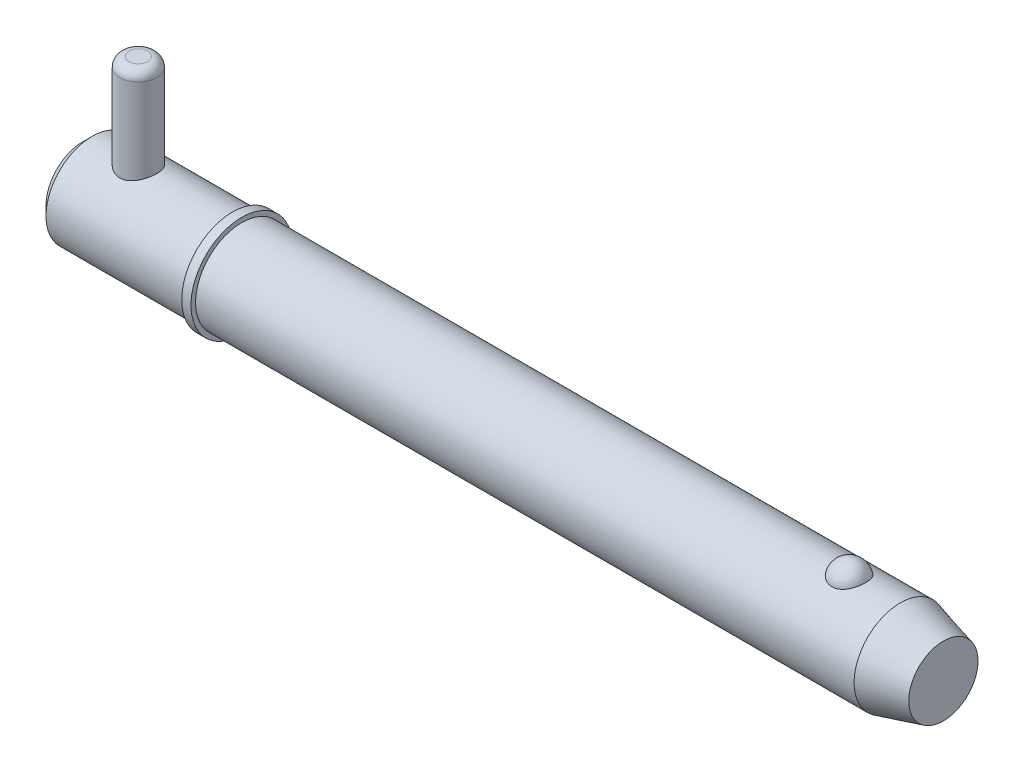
ISO-10303-21;
HEADER;
FILE_DESCRIPTION(('STEP AP214'),'2;1');
FILE_NAME('part.step','',(''),(''),'','','');
FILE_SCHEMA(('AUTOMOTIVE_DESIGN { 1 0 10303 214 1 1 1 1 }'));
ENDSEC;
DATA;
#1=APPLICATION_CONTEXT('core data for automotive mechanical design processes');
#2=APPLICATION_PROTOCOL_DEFINITION('international standard','automotive_design',2000,#1);
#3=PRODUCT_CONTEXT('',#1,'mechanical');
#4=PRODUCT('Part','Part','',(#3));
#5=PRODUCT_RELATED_PRODUCT_CATEGORY('part','',(#4));
#6=PRODUCT_DEFINITION_FORMATION('','',#4);
#7=PRODUCT_DEFINITION_CONTEXT('part definition',#1,'design');
#8=PRODUCT_DEFINITION('design','',#6,#7);
#9=PRODUCT_DEFINITION_SHAPE('','',#8);
#10=(LENGTH_UNIT() NAMED_UNIT(*) SI_UNIT(.MILLI.,.METRE.));
#11=(NAMED_UNIT(*) PLANE_ANGLE_UNIT() SI_UNIT($,.RADIAN.));
#12=(NAMED_UNIT(*) SI_UNIT($,.STERADIAN.) SOLID_ANGLE_UNIT());
#13=UNCERTAINTY_MEASURE_WITH_UNIT(LENGTH_MEASURE(1.E-05),#10,'distance_accuracy_value','');
#14=(GEOMETRIC_REPRESENTATION_CONTEXT(3) GLOBAL_UNCERTAINTY_ASSIGNED_CONTEXT((#13)) GLOBAL_UNIT_ASSIGNED_CONTEXT((#10,
#11,#12)) REPRESENTATION_CONTEXT('',''));
#15=CARTESIAN_POINT('',(0.,0.,0.));
#16=DIRECTION('',(0.,0.,1.));
#17=DIRECTION('',(1.,0.,0.));
#18=AXIS2_PLACEMENT_3D('',#15,#16,#17);
#19=CARTESIAN_POINT('',(9.525,23.81,0.));
#20=DIRECTION('',(0.,-1.,0.));
#21=DIRECTION('',(0.,0.,-1.));
#22=AXIS2_PLACEMENT_3D('',#19,#20,#21);
#23=CYLINDRICAL_SURFACE('',#22,3.175);
#24=CARTESIAN_POINT('',(9.525,-6.3525,0.));
#25=DIRECTION('',(0.,1.,0.));
#26=DIRECTION('',(0.,0.,1.));
#27=AXIS2_PLACEMENT_3D('',#24,#25,#26);
#28=CIRCLE('',#27,3.175);
#29=CARTESIAN_POINT('',(9.525,-6.3525,3.175));
#30=VERTEX_POINT('',#29);
#31=EDGE_CURVE('P0_E25',#30,#30,#28,.T.);
#32=ORIENTED_EDGE('',*,*,#31,.T.);
#33=EDGE_LOOP('',(#32));
#34=FACE_BOUND('',#33,.T.);
#35=CARTESIAN_POINT('',(9.525,22.2225,0.));
#36=DIRECTION('',(0.,1.,0.));
#37=DIRECTION('',(0.,0.,1.));
#38=AXIS2_PLACEMENT_3D('',#35,#36,#37);
#39=CIRCLE('',#38,3.175);
#40=CARTESIAN_POINT('',(9.525,22.2225,3.175));
#41=VERTEX_POINT('',#40);
#42=EDGE_CURVE('P0_E29',#41,#41,#39,.F.);
#43=ORIENTED_EDGE('',*,*,#42,.T.);
#44=EDGE_LOOP('',(#43));
#45=FACE_BOUND('',#44,.T.);
#46=ADVANCED_FACE('P0_F14',(#34,#45),#23,.T.);
#47=CARTESIAN_POINT('',(9.525,23.81,0.));
#48=DIRECTION('',(0.,1.,0.));
#49=DIRECTION('',(0.,0.,1.));
#50=AXIS2_PLACEMENT_3D('',#47,#48,#49);
#51=PLANE('',#50);
#52=CARTESIAN_POINT('',(9.525,23.81,0.));
#53=DIRECTION('',(0.,1.,0.));
#54=DIRECTION('',(0.,0.,1.));
#55=AXIS2_PLACEMENT_3D('',#52,#53,#54);
#56=CIRCLE('',#55,1.5875);
#57=CARTESIAN_POINT('',(9.525,23.81,1.5875));
#58=VERTEX_POINT('',#57);
#59=EDGE_CURVE('P0_E10',#58,#58,#56,.T.);
#60=ORIENTED_EDGE('',*,*,#59,.T.);
#61=EDGE_LOOP('',(#60));
#62=FACE_BOUND('',#61,.T.);
#63=ADVANCED_FACE('P0_F46',(#62),#51,.T.);
#64=CARTESIAN_POINT('',(9.525,-7.94,0.));
#65=DIRECTION('',(0.,1.,0.));
#66=DIRECTION('',(0.,0.,1.));
#67=AXIS2_PLACEMENT_3D('',#64,#65,#66);
#68=PLANE('',#67);
#69=CARTESIAN_POINT('',(9.525,-7.94,0.));
#70=DIRECTION('',(0.,1.,0.));
#71=DIRECTION('',(0.,0.,1.));
#72=AXIS2_PLACEMENT_3D('',#69,#70,#71);
#73=CIRCLE('',#72,1.5875);
#74=CARTESIAN_POINT('',(9.525,-7.94,1.5875));
#75=VERTEX_POINT('',#74);
#76=EDGE_CURVE('P0_E21',#75,#75,#73,.F.);
#77=ORIENTED_EDGE('',*,*,#76,.T.);
#78=EDGE_LOOP('',(#77));
#79=FACE_BOUND('',#78,.T.);
#80=ADVANCED_FACE('P0_F43',(#79),#68,.F.);
#81=CARTESIAN_POINT('',(9.525,-6.3525,0.));
#82=DIRECTION('',(0.,1.,0.));
#83=DIRECTION('',(0.,0.,1.));
#84=AXIS2_PLACEMENT_3D('',#81,#82,#83);
#85=DEGENERATE_TOROIDAL_SURFACE('',#84,1.5875,1.5875,.T.);
#86=ORIENTED_EDGE('',*,*,#76,.F.);
#87=EDGE_LOOP('',(#86));
#88=FACE_BOUND('',#87,.T.);
#89=ORIENTED_EDGE('',*,*,#31,.F.);
#90=EDGE_LOOP('',(#89));
#91=FACE_BOUND('',#90,.T.);
#92=ADVANCED_FACE('P0_F38',(#88,#91),#85,.T.);
#93=CARTESIAN_POINT('',(9.525,22.2225,0.));
#94=DIRECTION('',(0.,1.,0.));
#95=DIRECTION('',(0.,0.,1.));
#96=AXIS2_PLACEMENT_3D('',#93,#94,#95);
#97=DEGENERATE_TOROIDAL_SURFACE('',#96,1.5875,1.5875,.T.);
#98=ORIENTED_EDGE('',*,*,#42,.F.);
#99=EDGE_LOOP('',(#98));
#100=FACE_BOUND('',#99,.T.);
#101=ORIENTED_EDGE('',*,*,#59,.F.);
#102=EDGE_LOOP('',(#101));
#103=FACE_BOUND('',#102,.T.);
#104=ADVANCED_FACE('P0_F16',(#100,#103),#97,.T.);
#105=CLOSED_SHELL('',(#46,#63,#80,#92,#104));
#106=MANIFOLD_SOLID_BREP('P0_B1',#105);
#107=CARTESIAN_POINT('',(0.,0.,0.));
#108=DIRECTION('',(1.,0.,0.));
#109=DIRECTION('',(0.,0.,-1.));
#110=AXIS2_PLACEMENT_3D('',#107,#108,#109);
#111=CYLINDRICAL_SURFACE('',#110,7.94);
#112=CARTESIAN_POINT('',(140.551879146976,0.,0.));
#113=DIRECTION('',(1.,0.,0.));
#114=DIRECTION('',(0.,0.,-1.));
#115=AXIS2_PLACEMENT_3D('',#112,#113,#114);
#116=CIRCLE('',#115,7.94);
#117=CARTESIAN_POINT('',(140.551879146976,0.,-7.94));
#118=VERTEX_POINT('',#117);
#119=EDGE_CURVE('P1_E81',#118,#118,#116,.T.);
#120=ORIENTED_EDGE('',*,*,#119,.F.);
#121=EDGE_LOOP('',(#120));
#122=FACE_BOUND('',#121,.T.);
#123=CARTESIAN_POINT('',(27.31,0.,0.));
#124=DIRECTION('',(1.,0.,0.));
#125=DIRECTION('',(0.,0.,-1.));
#126=AXIS2_PLACEMENT_3D('',#123,#124,#125);
#127=CIRCLE('',#126,7.94);
#128=CARTESIAN_POINT('',(27.31,0.,-7.94));
#129=VERTEX_POINT('',#128);
#130=EDGE_CURVE('P1_E85',#129,#129,#127,.T.);
#131=ORIENTED_EDGE('',*,*,#130,.T.);
#132=EDGE_LOOP('',(#131));
#133=FACE_BOUND('',#132,.T.);
#134=CARTESIAN_POINT('',(131.744907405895,7.37767842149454,2.93486986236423));
#135=CARTESIAN_POINT('',(131.592749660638,7.3776732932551,2.93487505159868));
#136=CARTESIAN_POINT('',(131.440632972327,7.38258419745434,2.92262454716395));
#137=CARTESIAN_POINT('',(131.140928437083,7.40163229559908,2.87404196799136));
#138=CARTESIAN_POINT('',(130.993339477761,7.41576720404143,2.83771585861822));
#139=CARTESIAN_POINT('',(130.707018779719,7.45161576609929,2.74218769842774));
#140=CARTESIAN_POINT('',(130.568274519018,7.47331841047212,2.68301886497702));
#141=CARTESIAN_POINT('',(130.302882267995,7.52194082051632,2.54350967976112));
#142=CARTESIAN_POINT('',(130.176236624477,7.54886159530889,2.46316523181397));
#143=CARTESIAN_POINT('',(129.934534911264,7.60594671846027,2.28090375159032));
#144=CARTESIAN_POINT('',(129.819906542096,7.63618114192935,2.1784421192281));
#145=CARTESIAN_POINT('',(129.608878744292,7.69614046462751,1.95608495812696));
#146=CARTESIAN_POINT('',(129.512482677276,7.72586526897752,1.83618622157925));
#147=CARTESIAN_POINT('',(129.335938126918,7.78314821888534,1.57628086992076));
#148=CARTESIAN_POINT('',(129.256707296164,7.81055035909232,1.43561546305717));
#149=CARTESIAN_POINT('',(129.121797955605,7.85879631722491,1.14236334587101));
#150=CARTESIAN_POINT('',(129.066121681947,7.87963951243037,0.989775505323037));
#151=CARTESIAN_POINT('',(128.97881215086,7.91289645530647,0.674619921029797));
#152=CARTESIAN_POINT('',(128.94753090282,7.92518652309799,0.511941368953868));
#153=CARTESIAN_POINT('',(128.910975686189,7.93958930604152,0.183247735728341));
#154=CARTESIAN_POINT('',(128.905701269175,7.94170219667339,0.0172327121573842));
#155=CARTESIAN_POINT('',(128.921231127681,7.93554931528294,-0.312672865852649));
#156=CARTESIAN_POINT('',(128.941925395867,7.92732732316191,-0.476569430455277));
#157=CARTESIAN_POINT('',(129.00878655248,7.90141534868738,-0.79830524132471));
#158=CARTESIAN_POINT('',(129.054953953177,7.88372517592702,-0.956144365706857));
#159=CARTESIAN_POINT('',(129.171898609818,7.84066230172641,-1.26152073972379));
#160=CARTESIAN_POINT('',(129.242704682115,7.81528060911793,-1.40904568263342));
#161=CARTESIAN_POINT('',(129.407478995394,7.75948672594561,-1.68950598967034));
#162=CARTESIAN_POINT('',(129.501448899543,7.72907417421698,-1.82244030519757));
#163=CARTESIAN_POINT('',(129.710839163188,7.66640424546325,-2.07032792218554));
#164=CARTESIAN_POINT('',(129.826315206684,7.63414223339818,-2.18523308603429));
#165=CARTESIAN_POINT('',(130.0759006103,7.57149681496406,-2.39329737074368));
#166=CARTESIAN_POINT('',(130.210008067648,7.54111321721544,-2.48645870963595));
#167=CARTESIAN_POINT('',(130.490111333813,7.48650742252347,-2.64628132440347));
#168=CARTESIAN_POINT('',(130.635760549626,7.46215900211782,-2.71350554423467));
#169=CARTESIAN_POINT('',(130.937425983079,7.42171253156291,-2.82226614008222));
#170=CARTESIAN_POINT('',(131.093438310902,7.40561140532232,-2.86381209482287));
#171=CARTESIAN_POINT('',(131.402970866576,7.3842679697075,-2.9183907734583));
#172=CARTESIAN_POINT('',(131.556222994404,7.37852109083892,-2.93275024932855));
#173=CARTESIAN_POINT('',(131.863070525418,7.37700973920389,-2.93655208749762));
#174=CARTESIAN_POINT('',(132.016665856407,7.38124333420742,-2.92599927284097));
#175=CARTESIAN_POINT('',(132.314990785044,7.39890635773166,-2.88102897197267));
#176=CARTESIAN_POINT('',(132.459848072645,7.41205491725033,-2.84733999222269));
#177=CARTESIAN_POINT('',(132.74164329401,7.445801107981,-2.75788206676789));
#178=CARTESIAN_POINT('',(132.878580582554,7.46639934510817,-2.70211132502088));
#179=CARTESIAN_POINT('',(133.144061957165,7.51339098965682,-2.56858908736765));
#180=CARTESIAN_POINT('',(133.272354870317,7.53990200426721,-2.4903806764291));
#181=CARTESIAN_POINT('',(133.514244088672,7.59569503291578,-2.31462737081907));
#182=CARTESIAN_POINT('',(133.627837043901,7.6249776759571,-2.21707808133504));
#183=CARTESIAN_POINT('',(133.84322156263,7.68489473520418,-1.99982049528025));
#184=CARTESIAN_POINT('',(133.944148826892,7.71552419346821,-1.87925337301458));
#185=CARTESIAN_POINT('',(134.125186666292,7.77353016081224,-1.6226882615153));
#186=CARTESIAN_POINT('',(134.205293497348,7.80090608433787,-1.48668750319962));
#187=CARTESIAN_POINT('',(134.345361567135,7.85047992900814,-1.1981841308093));
#188=CARTESIAN_POINT('',(134.404587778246,7.87248183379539,-1.04529016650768));
#189=CARTESIAN_POINT('',(134.497982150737,7.90785114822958,-0.731080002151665));
#190=CARTESIAN_POINT('',(134.532149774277,7.92121837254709,-0.569763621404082));
#191=CARTESIAN_POINT('',(134.574795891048,7.93797834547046,-0.242812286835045));
#192=CARTESIAN_POINT('',(134.583204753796,7.94134405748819,-0.0771668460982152));
#193=CARTESIAN_POINT('',(134.573962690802,7.93767937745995,0.253276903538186));
#194=CARTESIAN_POINT('',(134.556312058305,7.93064910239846,0.418075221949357));
#195=CARTESIAN_POINT('',(134.495424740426,7.90695571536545,0.741525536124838));
#196=CARTESIAN_POINT('',(134.452281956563,7.8903279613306,0.900197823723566));
#197=CARTESIAN_POINT('',(134.34135358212,7.84916386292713,1.20759654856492));
#198=CARTESIAN_POINT('',(134.27356656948,7.82462706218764,1.35632241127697));
#199=CARTESIAN_POINT('',(134.114371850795,7.77006699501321,1.64032869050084));
#200=CARTESIAN_POINT('',(134.022861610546,7.74002008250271,1.7755471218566));
#201=CARTESIAN_POINT('',(133.818296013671,7.67774175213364,2.0280064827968));
#202=CARTESIAN_POINT('',(133.705241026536,7.64551037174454,2.14524772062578));
#203=CARTESIAN_POINT('',(133.460831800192,7.58265895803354,2.35778002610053));
#204=CARTESIAN_POINT('',(133.329583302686,7.5520309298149,2.45319004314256));
#205=CARTESIAN_POINT('',(133.051601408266,7.49579792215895,2.61999897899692));
#206=CARTESIAN_POINT('',(132.904867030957,7.4701932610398,2.69139637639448));
#207=CARTESIAN_POINT('',(132.592947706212,7.42622216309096,2.8105324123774));
#208=CARTESIAN_POINT('',(132.427220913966,7.40825002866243,2.85700910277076));
#209=CARTESIAN_POINT('',(132.089279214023,7.38398348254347,2.9191685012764));
#210=CARTESIAN_POINT('',(131.91706702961,7.3776842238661,2.93486399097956));
#211=CARTESIAN_POINT('',(131.744907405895,7.37767842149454,2.93486986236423));
#212=B_SPLINE_CURVE_WITH_KNOTS('',3,(#134,#135,#136,#137,#138,#139,#140,#141,#142,#143,#144,
#145,#146,#147,#148,#149,#150,#151,#152,#153,#154,#155,#156,#157,#158,#159,#160,#161,#162,#163,
#164,#165,#166,#167,#168,#169,#170,#171,#172,#173,#174,#175,#176,#177,#178,#179,#180,#181,#182,
#183,#184,#185,#186,#187,#188,#189,#190,#191,#192,#193,#194,#195,#196,#197,#198,#199,#200,#201,
#202,#203,#204,#205,#206,#207,#208,#209,#210,#211),.UNSPECIFIED.,.T.,.F.,(4,2,2,2,2,2,2,2,2,2,2,
2,2,2,2,2,2,2,2,2,2,2,2,2,2,2,2,2,2,2,2,2,2,2,2,2,2,2,4),(0.,0.455841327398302,
0.911569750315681,1.36663794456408,1.82179423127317,2.2897898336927,2.75787163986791,
3.24685368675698,3.73588214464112,4.23184282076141,4.72779494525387,5.22165321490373,
5.71552141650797,6.20996917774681,6.7044524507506,7.20023431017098,7.69596557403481,
8.18023418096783,8.66432203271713,9.12410697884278,9.58380291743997,10.0296503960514,
10.4755341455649,10.9312349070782,11.3870393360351,11.8654416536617,12.3439299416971,
12.8378875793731,13.3318558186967,13.8271581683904,14.3224549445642,14.8159385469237,
15.3094506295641,15.8051323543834,16.3008055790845,16.7937101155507,17.2866458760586,
17.8026240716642,18.3183879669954),.UNSPECIFIED.);
#213=CARTESIAN_POINT('',(131.744907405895,7.37767842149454,2.93486986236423));
#214=VERTEX_POINT('',#213);
#215=EDGE_CURVE('P1_E35',#214,#214,#212,.T.);
#216=ORIENTED_EDGE('',*,*,#215,.T.);
#217=EDGE_LOOP('',(#216));
#218=FACE_BOUND('',#217,.T.);
#219=ADVANCED_FACE('P1_F13',(#122,#133,#218),#111,.T.);
#220=CARTESIAN_POINT('',(0.,0.,0.));
#221=DIRECTION('',(-1.,0.,0.));
#222=DIRECTION('',(0.,0.,1.));
#223=AXIS2_PLACEMENT_3D('',#220,#221,#222);
#224=PLANE('',#223);
#225=CARTESIAN_POINT('',(0.,0.,0.));
#226=DIRECTION('',(1.,0.,0.));
#227=DIRECTION('',(0.,0.,-1.));
#228=AXIS2_PLACEMENT_3D('',#225,#226,#227);
#229=CIRCLE('',#228,6.352);
#230=CARTESIAN_POINT('',(0.,0.,-6.352));
#231=VERTEX_POINT('',#230);
#232=EDGE_CURVE('P1_E9',#231,#231,#229,.T.);
#233=ORIENTED_EDGE('',*,*,#232,.F.);
#234=EDGE_LOOP('',(#233));
#235=FACE_BOUND('',#234,.T.);
#236=ADVANCED_FACE('P1_F15',(#235),#224,.T.);
#237=CARTESIAN_POINT('',(1.58799999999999,0.,0.));
#238=DIRECTION('',(1.,0.,0.));
#239=DIRECTION('',(0.,0.,-1.));
#240=AXIS2_PLACEMENT_3D('',#237,#238,#239);
#241=CONICAL_SURFACE('',#240,7.94,0.78539816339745);
#242=ORIENTED_EDGE('',*,*,#232,.T.);
#243=EDGE_LOOP('',(#242));
#244=FACE_BOUND('',#243,.T.);
#245=CARTESIAN_POINT('',(1.58799999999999,0.,0.));
#246=DIRECTION('',(1.,0.,0.));
#247=DIRECTION('',(0.,0.,-1.));
#248=AXIS2_PLACEMENT_3D('',#245,#246,#247);
#249=CIRCLE('',#248,7.94);
#250=CARTESIAN_POINT('',(1.58799999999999,0.,-7.94));
#251=VERTEX_POINT('',#250);
#252=EDGE_CURVE('P1_E26',#251,#251,#249,.T.);
#253=ORIENTED_EDGE('',*,*,#252,.F.);
#254=EDGE_LOOP('',(#253));
#255=FACE_BOUND('',#254,.T.);
#256=ADVANCED_FACE('P1_F77',(#244,#255),#241,.T.);
#257=CARTESIAN_POINT('',(0.,0.,0.));
#258=DIRECTION('',(1.,0.,0.));
#259=DIRECTION('',(0.,0.,-1.));
#260=AXIS2_PLACEMENT_3D('',#257,#258,#259);
#261=CYLINDRICAL_SURFACE('',#260,7.94);
#262=CARTESIAN_POINT('',(9.525,-7.27756655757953,3.175));
#263=CARTESIAN_POINT('',(9.43992346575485,-7.27756715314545,3.17499935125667));
#264=CARTESIAN_POINT('',(9.35481882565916,-7.27906496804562,3.1715736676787));
#265=CARTESIAN_POINT('',(9.18524505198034,-7.28499816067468,3.15791803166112));
#266=CARTESIAN_POINT('',(9.100776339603,-7.28943533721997,3.14768391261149));
#267=CARTESIAN_POINT('',(8.84895715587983,-7.30698881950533,3.10684226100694));
#268=CARTESIAN_POINT('',(8.6834173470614,-7.32434654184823,3.06609574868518));
#269=CARTESIAN_POINT('',(8.36278910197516,-7.36806950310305,2.95945910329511));
#270=CARTESIAN_POINT('',(8.20766386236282,-7.39440078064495,2.89366366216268));
#271=CARTESIAN_POINT('',(7.91065319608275,-7.45304562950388,2.73907413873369));
#272=CARTESIAN_POINT('',(7.76876488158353,-7.48535789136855,2.65028508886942));
#273=CARTESIAN_POINT('',(7.49411086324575,-7.55439482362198,2.44679888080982));
#274=CARTESIAN_POINT('',(7.36219910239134,-7.59126138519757,2.33099745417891));
#275=CARTESIAN_POINT('',(7.11904234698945,-7.66408045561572,2.07909838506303));
#276=CARTESIAN_POINT('',(7.00780457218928,-7.70003264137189,1.94299368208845));
#277=CARTESIAN_POINT('',(6.80492173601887,-7.76867514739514,1.64775981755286));
#278=CARTESIAN_POINT('',(6.71422139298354,-7.80118112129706,1.48793473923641));
#279=CARTESIAN_POINT('',(6.56135788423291,-7.85754918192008,1.15376269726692));
#280=CARTESIAN_POINT('',(6.49918311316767,-7.88141478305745,0.979421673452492));
#281=CARTESIAN_POINT('',(6.40818142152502,-7.91680873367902,0.630115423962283));
#282=CARTESIAN_POINT('',(6.3778864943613,-7.9288781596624,0.455588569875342));
#283=CARTESIAN_POINT('',(6.34677743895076,-7.94127547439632,0.103539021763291));
#284=CARTESIAN_POINT('',(6.34595232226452,-7.94160773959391,-0.0739825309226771));
#285=CARTESIAN_POINT('',(6.37300128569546,-7.93082261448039,-0.416371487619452));
#286=CARTESIAN_POINT('',(6.39926693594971,-7.92034690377,-0.581389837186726));
#287=CARTESIAN_POINT('',(6.47701615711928,-7.88998770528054,-0.904449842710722));
#288=CARTESIAN_POINT('',(6.52850157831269,-7.87010352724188,-1.06249098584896));
#289=CARTESIAN_POINT('',(6.65586120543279,-7.82249343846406,-1.36995769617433));
#290=CARTESIAN_POINT('',(6.73209124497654,-7.79465387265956,-1.51921754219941));
#291=CARTESIAN_POINT('',(6.90644286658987,-7.73389606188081,-1.80321183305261));
#292=CARTESIAN_POINT('',(7.00457194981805,-7.70097607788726,-1.93794127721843));
#293=CARTESIAN_POINT('',(7.22744086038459,-7.63084889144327,-2.19843606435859));
#294=CARTESIAN_POINT('',(7.35350432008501,-7.59350211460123,-2.3230330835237));
#295=CARTESIAN_POINT('',(7.62488266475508,-7.52039654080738,-2.54979642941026));
#296=CARTESIAN_POINT('',(7.77020381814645,-7.48463826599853,-2.65195542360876));
#297=CARTESIAN_POINT('',(8.08119298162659,-7.41780943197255,-2.83361305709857));
#298=CARTESIAN_POINT('',(8.24731937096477,-7.38689959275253,-2.91239105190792));
#299=CARTESIAN_POINT('',(8.59204539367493,-7.33515216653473,-3.04038913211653));
#300=CARTESIAN_POINT('',(8.77063684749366,-7.31430804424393,-3.08962840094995));
#301=CARTESIAN_POINT('',(9.12356982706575,-7.28663831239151,-3.15431018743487));
#302=CARTESIAN_POINT('',(9.29750494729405,-7.2790344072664,-3.17163284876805));
#303=CARTESIAN_POINT('',(9.64592502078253,-7.27648884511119,-3.17747282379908));
#304=CARTESIAN_POINT('',(9.82040979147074,-7.28154335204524,-3.16599886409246));
#305=CARTESIAN_POINT('',(10.1545374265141,-7.30294638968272,-3.11628310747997));
#306=CARTESIAN_POINT('',(10.3144598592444,-7.31863587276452,-3.0796016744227));
#307=CARTESIAN_POINT('',(10.625774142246,-7.35872371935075,-2.98253618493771));
#308=CARTESIAN_POINT('',(10.7771640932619,-7.38312401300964,-2.92214687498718));
#309=CARTESIAN_POINT('',(11.0739599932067,-7.4390944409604,-2.77664664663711));
#310=CARTESIAN_POINT('',(11.2188745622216,-7.47091513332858,-2.69063278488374));
#311=CARTESIAN_POINT('',(11.4928722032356,-7.53775867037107,-2.49724834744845));
#312=CARTESIAN_POINT('',(11.6219487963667,-7.57278281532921,-2.38986907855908));
#313=CARTESIAN_POINT('',(11.8705091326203,-7.64520845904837,-2.1474449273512));
#314=CARTESIAN_POINT('',(11.9885816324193,-7.68259462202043,-2.01094304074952));
#315=CARTESIAN_POINT('',(12.2003631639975,-7.75309951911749,-1.71917041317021));
#316=CARTESIAN_POINT('',(12.2940712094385,-7.78621808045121,-1.56389891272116));
#317=CARTESIAN_POINT('',(12.4541161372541,-7.84456050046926,-1.23845027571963));
#318=CARTESIAN_POINT('',(12.5204600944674,-7.86978639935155,-1.06827700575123));
#319=CARTESIAN_POINT('',(12.6231407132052,-7.90943635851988,-0.717928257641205));
#320=CARTESIAN_POINT('',(12.6594936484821,-7.92386627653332,-0.537758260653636));
#321=CARTESIAN_POINT('',(12.6992281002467,-7.93967263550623,-0.185201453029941));
#322=CARTESIAN_POINT('',(12.7046050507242,-7.94183891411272,-0.0130732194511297));
#323=CARTESIAN_POINT('',(12.6875036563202,-7.9350072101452,0.329549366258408));
#324=CARTESIAN_POINT('',(12.6650295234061,-7.92601091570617,0.500043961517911));
#325=CARTESIAN_POINT('',(12.5942896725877,-7.89825976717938,0.829196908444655));
#326=CARTESIAN_POINT('',(12.5468364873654,-7.87981280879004,0.988057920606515));
#327=CARTESIAN_POINT('',(12.4283390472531,-7.83513565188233,1.29553461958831));
#328=CARTESIAN_POINT('',(12.3572904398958,-7.8089040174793,1.44414841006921));
#329=CARTESIAN_POINT('',(12.1900822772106,-7.7497911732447,1.73412879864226));
#330=CARTESIAN_POINT('',(12.0929519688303,-7.71666737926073,1.87488510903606));
#331=CARTESIAN_POINT('',(11.8777894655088,-7.64775894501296,2.13869231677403));
#332=CARTESIAN_POINT('',(11.7597486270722,-7.61197320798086,2.26173585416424));
#333=CARTESIAN_POINT('',(11.4974896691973,-7.53902341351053,2.49449755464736));
#334=CARTESIAN_POINT('',(11.3521039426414,-7.50191102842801,2.60292060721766));
#335=CARTESIAN_POINT('',(11.0440201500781,-7.43289551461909,2.79392602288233));
#336=CARTESIAN_POINT('',(10.8813200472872,-7.40099299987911,2.87650534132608));
#337=CARTESIAN_POINT('',(10.558064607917,-7.3489506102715,3.00682739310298));
#338=CARTESIAN_POINT('',(10.398627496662,-7.32801197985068,3.05703164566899));
#339=CARTESIAN_POINT('',(10.0731242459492,-7.29639491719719,3.13175843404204));
#340=CARTESIAN_POINT('',(9.90707793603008,-7.28568789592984,3.15635254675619));
#341=CARTESIAN_POINT('',(9.70441566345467,-7.27968826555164,3.17013149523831));
#342=CARTESIAN_POINT('',(9.66856669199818,-7.27889378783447,3.17195593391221));
#343=CARTESIAN_POINT('',(9.59681348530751,-7.27783278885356,3.17439036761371));
#344=CARTESIAN_POINT('',(9.56090924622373,-7.27756630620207,3.17500027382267));
#345=CARTESIAN_POINT('',(9.525,-7.27756655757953,3.175));
#346=B_SPLINE_CURVE_WITH_KNOTS('',3,(#262,#263,#264,#265,#266,#267,#268,#269,#270,#271,#272,
#273,#274,#275,#276,#277,#278,#279,#280,#281,#282,#283,#284,#285,#286,#287,#288,#289,#290,#291,
#292,#293,#294,#295,#296,#297,#298,#299,#300,#301,#302,#303,#304,#305,#306,#307,#308,#309,#310,
#311,#312,#313,#314,#315,#316,#317,#318,#319,#320,#321,#322,#323,#324,#325,#326,#327,#328,#329,
#330,#331,#332,#333,#334,#335,#336,#337,#338,#339,#340,#341,#342,#343,#344,#345),.UNSPECIFIED.,
.T.,.F.,(4,2,2,2,2,2,2,2,2,2,2,2,2,2,2,2,2,2,2,2,2,2,2,2,2,2,2,2,2,2,2,2,2,2,2,2,2,2,2,2,2,4),
(0.,0.255187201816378,0.510530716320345,1.0218798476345,1.53131482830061,2.04063840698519,
2.57635929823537,3.11226692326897,3.66929090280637,4.22608806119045,4.75594400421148,
5.28560237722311,5.78552836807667,6.28549104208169,6.79298787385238,7.30065880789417,
7.8416422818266,8.38280228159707,8.93923025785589,9.49529647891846,10.0174074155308,
10.5393601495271,11.0316114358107,11.5239718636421,12.0362920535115,12.5488211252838,
13.0991799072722,13.6495609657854,14.1997996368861,14.7497395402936,15.2638187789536,
15.7778202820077,16.2760504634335,16.7743726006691,17.294711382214,17.8152657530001,
18.3680208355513,18.9208410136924,19.4240423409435,19.9258334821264,20.0335354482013,
20.1412452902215),.UNSPECIFIED.);
#347=CARTESIAN_POINT('',(9.525,-7.27756655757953,3.175));
#348=VERTEX_POINT('',#347);
#349=EDGE_CURVE('P1_E17',#348,#348,#346,.T.);
#350=ORIENTED_EDGE('',*,*,#349,.F.);
#351=EDGE_LOOP('',(#350));
#352=FACE_BOUND('',#351,.T.);
#353=CARTESIAN_POINT('',(9.525,7.27756655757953,3.175));
#354=CARTESIAN_POINT('',(9.61007653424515,7.27756715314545,3.17499935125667));
#355=CARTESIAN_POINT('',(9.69518117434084,7.27906496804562,3.1715736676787));
#356=CARTESIAN_POINT('',(9.86475494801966,7.28499816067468,3.15791803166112));
#357=CARTESIAN_POINT('',(9.949223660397,7.28943533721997,3.14768391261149));
#358=CARTESIAN_POINT('',(10.2010428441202,7.30698881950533,3.10684226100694));
#359=CARTESIAN_POINT('',(10.3665826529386,7.32434654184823,3.06609574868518));
#360=CARTESIAN_POINT('',(10.6872108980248,7.36806950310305,2.95945910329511));
#361=CARTESIAN_POINT('',(10.8423361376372,7.39440078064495,2.89366366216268));
#362=CARTESIAN_POINT('',(11.1393468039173,7.45304562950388,2.73907413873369));
#363=CARTESIAN_POINT('',(11.2812351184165,7.48535789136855,2.65028508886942));
#364=CARTESIAN_POINT('',(11.5558891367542,7.55439482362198,2.44679888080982));
#365=CARTESIAN_POINT('',(11.6878008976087,7.59126138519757,2.33099745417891));
#366=CARTESIAN_POINT('',(11.9309576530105,7.66408045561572,2.07909838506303));
#367=CARTESIAN_POINT('',(12.0421954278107,7.70003264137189,1.94299368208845));
#368=CARTESIAN_POINT('',(12.2450782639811,7.76867514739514,1.64775981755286));
#369=CARTESIAN_POINT('',(12.3357786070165,7.80118112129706,1.48793473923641));
#370=CARTESIAN_POINT('',(12.4886421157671,7.85754918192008,1.15376269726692));
#371=CARTESIAN_POINT('',(12.5508168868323,7.88141478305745,0.979421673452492));
#372=CARTESIAN_POINT('',(12.641818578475,7.91680873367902,0.630115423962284));
#373=CARTESIAN_POINT('',(12.6721135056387,7.9288781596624,0.455588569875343));
#374=CARTESIAN_POINT('',(12.7032225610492,7.94127547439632,0.103539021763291));
#375=CARTESIAN_POINT('',(12.7040476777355,7.94160773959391,-0.0739825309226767));
#376=CARTESIAN_POINT('',(12.6769987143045,7.93082261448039,-0.416371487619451));
#377=CARTESIAN_POINT('',(12.6507330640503,7.92034690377,-0.581389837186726));
#378=CARTESIAN_POINT('',(12.5729838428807,7.88998770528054,-0.904449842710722));
#379=CARTESIAN_POINT('',(12.5214984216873,7.87010352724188,-1.06249098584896));
#380=CARTESIAN_POINT('',(12.3941387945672,7.82249343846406,-1.36995769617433));
#381=CARTESIAN_POINT('',(12.3179087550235,7.79465387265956,-1.51921754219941));
#382=CARTESIAN_POINT('',(12.1435571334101,7.73389606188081,-1.80321183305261));
#383=CARTESIAN_POINT('',(12.0454280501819,7.70097607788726,-1.93794127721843));
#384=CARTESIAN_POINT('',(11.8225591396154,7.63084889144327,-2.19843606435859));
#385=CARTESIAN_POINT('',(11.696495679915,7.59350211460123,-2.3230330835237));
#386=CARTESIAN_POINT('',(11.4251173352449,7.52039654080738,-2.54979642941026));
#387=CARTESIAN_POINT('',(11.2797961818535,7.48463826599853,-2.65195542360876));
#388=CARTESIAN_POINT('',(10.9688070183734,7.41780943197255,-2.83361305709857));
#389=CARTESIAN_POINT('',(10.8026806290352,7.38689959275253,-2.91239105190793));
#390=CARTESIAN_POINT('',(10.4579546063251,7.33515216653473,-3.04038913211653));
#391=CARTESIAN_POINT('',(10.2793631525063,7.31430804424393,-3.08962840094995));
#392=CARTESIAN_POINT('',(9.92643017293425,7.28663831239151,-3.15431018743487));
#393=CARTESIAN_POINT('',(9.75249505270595,7.2790344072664,-3.17163284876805));
#394=CARTESIAN_POINT('',(9.40407497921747,7.2764888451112,-3.17747282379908));
#395=CARTESIAN_POINT('',(9.22959020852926,7.28154335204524,-3.16599886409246));
#396=CARTESIAN_POINT('',(8.89546257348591,7.30294638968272,-3.11628310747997));
#397=CARTESIAN_POINT('',(8.73554014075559,7.31863587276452,-3.0796016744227));
#398=CARTESIAN_POINT('',(8.42422585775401,7.35872371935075,-2.98253618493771));
#399=CARTESIAN_POINT('',(8.27283590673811,7.38312401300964,-2.92214687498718));
#400=CARTESIAN_POINT('',(7.97604000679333,7.4390944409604,-2.77664664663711));
#401=CARTESIAN_POINT('',(7.83112543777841,7.47091513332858,-2.69063278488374));
#402=CARTESIAN_POINT('',(7.55712779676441,7.53775867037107,-2.49724834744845));
#403=CARTESIAN_POINT('',(7.42805120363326,7.57278281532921,-2.38986907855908));
#404=CARTESIAN_POINT('',(7.17949086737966,7.64520845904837,-2.1474449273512));
#405=CARTESIAN_POINT('',(7.06141836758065,7.68259462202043,-2.01094304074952));
#406=CARTESIAN_POINT('',(6.8496368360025,7.75309951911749,-1.71917041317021));
#407=CARTESIAN_POINT('',(6.75592879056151,7.78621808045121,-1.56389891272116));
#408=CARTESIAN_POINT('',(6.59588386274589,7.84456050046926,-1.23845027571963));
#409=CARTESIAN_POINT('',(6.52953990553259,7.86978639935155,-1.06827700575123));
#410=CARTESIAN_POINT('',(6.42685928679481,7.90943635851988,-0.717928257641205));
#411=CARTESIAN_POINT('',(6.39050635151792,7.92386627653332,-0.537758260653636));
#412=CARTESIAN_POINT('',(6.35077189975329,7.93967263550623,-0.18520145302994));
#413=CARTESIAN_POINT('',(6.34539494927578,7.94183891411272,-0.0130732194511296));
#414=CARTESIAN_POINT('',(6.36249634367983,7.9350072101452,0.329549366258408));
#415=CARTESIAN_POINT('',(6.38497047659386,7.92601091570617,0.500043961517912));
#416=CARTESIAN_POINT('',(6.45571032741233,7.89825976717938,0.829196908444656));
#417=CARTESIAN_POINT('',(6.50316351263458,7.87981280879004,0.988057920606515));
#418=CARTESIAN_POINT('',(6.62166095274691,7.83513565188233,1.29553461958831));
#419=CARTESIAN_POINT('',(6.69270956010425,7.8089040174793,1.44414841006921));
#420=CARTESIAN_POINT('',(6.85991772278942,7.7497911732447,1.73412879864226));
#421=CARTESIAN_POINT('',(6.95704803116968,7.71666737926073,1.87488510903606));
#422=CARTESIAN_POINT('',(7.17221053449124,7.64775894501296,2.13869231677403));
#423=CARTESIAN_POINT('',(7.29025137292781,7.61197320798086,2.26173585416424));
#424=CARTESIAN_POINT('',(7.55251033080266,7.53902341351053,2.49449755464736));
#425=CARTESIAN_POINT('',(7.69789605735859,7.50191102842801,2.60292060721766));
#426=CARTESIAN_POINT('',(8.00597984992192,7.43289551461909,2.79392602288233));
#427=CARTESIAN_POINT('',(8.16867995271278,7.40099299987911,2.87650534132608));
#428=CARTESIAN_POINT('',(8.49193539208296,7.3489506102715,3.00682739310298));
#429=CARTESIAN_POINT('',(8.65137250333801,7.32801197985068,3.05703164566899));
#430=CARTESIAN_POINT('',(8.97687575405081,7.29639491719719,3.13175843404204));
#431=CARTESIAN_POINT('',(9.14292206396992,7.28568789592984,3.15635254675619));
#432=CARTESIAN_POINT('',(9.34558433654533,7.27968826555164,3.17013149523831));
#433=CARTESIAN_POINT('',(9.38143330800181,7.27889378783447,3.17195593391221));
#434=CARTESIAN_POINT('',(9.45318651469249,7.27783278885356,3.17439036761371));
#435=CARTESIAN_POINT('',(9.48909075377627,7.27756630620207,3.17500027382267));
#436=CARTESIAN_POINT('',(9.525,7.27756655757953,3.175));
#437=B_SPLINE_CURVE_WITH_KNOTS('',3,(#353,#354,#355,#356,#357,#358,#359,#360,#361,#362,#363,
#364,#365,#366,#367,#368,#369,#370,#371,#372,#373,#374,#375,#376,#377,#378,#379,#380,#381,#382,
#383,#384,#385,#386,#387,#388,#389,#390,#391,#392,#393,#394,#395,#396,#397,#398,#399,#400,#401,
#402,#403,#404,#405,#406,#407,#408,#409,#410,#411,#412,#413,#414,#415,#416,#417,#418,#419,#420,
#421,#422,#423,#424,#425,#426,#427,#428,#429,#430,#431,#432,#433,#434,#435,#436),.UNSPECIFIED.,
.T.,.F.,(4,2,2,2,2,2,2,2,2,2,2,2,2,2,2,2,2,2,2,2,2,2,2,2,2,2,2,2,2,2,2,2,2,2,2,2,2,2,2,2,2,4),
(0.,0.255187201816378,0.510530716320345,1.0218798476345,1.53131482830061,2.04063840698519,
2.57635929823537,3.11226692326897,3.66929090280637,4.22608806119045,4.75594400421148,
5.2856023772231,5.78552836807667,6.28549104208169,6.79298787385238,7.30065880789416,
7.8416422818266,8.38280228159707,8.9392302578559,9.49529647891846,10.0174074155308,
10.5393601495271,11.0316114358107,11.5239718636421,12.0362920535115,12.5488211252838,
13.0991799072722,13.6495609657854,14.1997996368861,14.7497395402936,15.2638187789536,
15.7778202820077,16.2760504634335,16.7743726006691,17.294711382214,17.8152657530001,
18.3680208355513,18.9208410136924,19.4240423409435,19.9258334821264,20.0335354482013,
20.1412452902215),.UNSPECIFIED.);
#438=CARTESIAN_POINT('',(9.525,7.27756655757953,3.175));
#439=VERTEX_POINT('',#438);
#440=EDGE_CURVE('P1_E43',#439,#439,#437,.T.);
#441=ORIENTED_EDGE('',*,*,#440,.F.);
#442=EDGE_LOOP('',(#441));
#443=FACE_BOUND('',#442,.T.);
#444=ORIENTED_EDGE('',*,*,#252,.T.);
#445=EDGE_LOOP('',(#444));
#446=FACE_BOUND('',#445,.T.);
#447=CARTESIAN_POINT('',(25.722,0.,0.));
#448=DIRECTION('',(1.,0.,0.));
#449=DIRECTION('',(0.,0.,-1.));
#450=AXIS2_PLACEMENT_3D('',#447,#448,#449);
#451=CIRCLE('',#450,7.94);
#452=CARTESIAN_POINT('',(25.722,0.,-7.94));
#453=VERTEX_POINT('',#452);
#454=EDGE_CURVE('P1_E31',#453,#453,#451,.T.);
#455=ORIENTED_EDGE('',*,*,#454,.F.);
#456=EDGE_LOOP('',(#455));
#457=FACE_BOUND('',#456,.T.);
#458=ADVANCED_FACE('P1_F103',(#352,#443,#446,#457),#261,.T.);
#459=CARTESIAN_POINT('',(25.722,7.94,0.));
#460=DIRECTION('',(-1.,0.,0.));
#461=DIRECTION('',(0.,0.,1.));
#462=AXIS2_PLACEMENT_3D('',#459,#460,#461);
#463=PLANE('',#462);
#464=ORIENTED_EDGE('',*,*,#454,.T.);
#465=EDGE_LOOP('',(#464));
#466=FACE_BOUND('',#465,.T.);
#467=CARTESIAN_POINT('',(25.722,0.,0.));
#468=DIRECTION('',(1.,0.,0.));
#469=DIRECTION('',(0.,0.,-1.));
#470=AXIS2_PLACEMENT_3D('',#467,#468,#469);
#471=CIRCLE('',#470,8.734);
#472=CARTESIAN_POINT('',(25.722,0.,-8.734));
#473=VERTEX_POINT('',#472);
#474=EDGE_CURVE('P1_E91',#473,#473,#471,.T.);
#475=ORIENTED_EDGE('',*,*,#474,.F.);
#476=EDGE_LOOP('',(#475));
#477=FACE_BOUND('',#476,.T.);
#478=ADVANCED_FACE('P1_F100',(#466,#477),#463,.T.);
#479=CARTESIAN_POINT('',(0.,0.,0.));
#480=DIRECTION('',(1.,0.,0.));
#481=DIRECTION('',(0.,0.,-1.));
#482=AXIS2_PLACEMENT_3D('',#479,#480,#481);
#483=CYLINDRICAL_SURFACE('',#482,8.734);
#484=ORIENTED_EDGE('',*,*,#474,.T.);
#485=EDGE_LOOP('',(#484));
#486=FACE_BOUND('',#485,.T.);
#487=CARTESIAN_POINT('',(27.31,0.,0.));
#488=DIRECTION('',(1.,0.,0.));
#489=DIRECTION('',(0.,0.,-1.));
#490=AXIS2_PLACEMENT_3D('',#487,#488,#489);
#491=CIRCLE('',#490,8.734);
#492=CARTESIAN_POINT('',(27.31,0.,-8.734));
#493=VERTEX_POINT('',#492);
#494=EDGE_CURVE('P1_E88',#493,#493,#491,.T.);
#495=ORIENTED_EDGE('',*,*,#494,.F.);
#496=EDGE_LOOP('',(#495));
#497=FACE_BOUND('',#496,.T.);
#498=ADVANCED_FACE('P1_F68',(#486,#497),#483,.T.);
#499=CARTESIAN_POINT('',(27.31,8.734,0.));
#500=DIRECTION('',(1.,0.,0.));
#501=DIRECTION('',(0.,0.,-1.));
#502=AXIS2_PLACEMENT_3D('',#499,#500,#501);
#503=PLANE('',#502);
#504=ORIENTED_EDGE('',*,*,#494,.T.);
#505=EDGE_LOOP('',(#504));
#506=FACE_BOUND('',#505,.T.);
#507=ORIENTED_EDGE('',*,*,#130,.F.);
#508=EDGE_LOOP('',(#507));
#509=FACE_BOUND('',#508,.T.);
#510=ADVANCED_FACE('P1_F62',(#506,#509),#503,.T.);
#511=CARTESIAN_POINT('',(147.96,0.,0.));
#512=DIRECTION('',(-1.,0.,0.));
#513=DIRECTION('',(0.,0.,1.));
#514=AXIS2_PLACEMENT_3D('',#511,#512,#513);
#515=CONICAL_SURFACE('',#514,5.95500000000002,0.26179938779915);
#516=ORIENTED_EDGE('',*,*,#119,.T.);
#517=EDGE_LOOP('',(#516));
#518=FACE_BOUND('',#517,.T.);
#519=CARTESIAN_POINT('',(147.96,0.,0.));
#520=DIRECTION('',(1.,0.,0.));
#521=DIRECTION('',(0.,0.,-1.));
#522=AXIS2_PLACEMENT_3D('',#519,#520,#521);
#523=CIRCLE('',#522,5.95500000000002);
#524=CARTESIAN_POINT('',(147.96,0.,-5.95500000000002));
#525=VERTEX_POINT('',#524);
#526=EDGE_CURVE('P1_E42',#525,#525,#523,.T.);
#527=ORIENTED_EDGE('',*,*,#526,.F.);
#528=EDGE_LOOP('',(#527));
#529=FACE_BOUND('',#528,.T.);
#530=ADVANCED_FACE('P1_F59',(#518,#529),#515,.T.);
#531=CARTESIAN_POINT('',(147.96,5.95500000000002,0.));
#532=DIRECTION('',(1.,0.,0.));
#533=DIRECTION('',(0.,0.,-1.));
#534=AXIS2_PLACEMENT_3D('',#531,#532,#533);
#535=PLANE('',#534);
#536=ORIENTED_EDGE('',*,*,#526,.T.);
#537=EDGE_LOOP('',(#536));
#538=FACE_BOUND('',#537,.T.);
#539=ADVANCED_FACE('P1_F55',(#538),#535,.T.);
#540=CARTESIAN_POINT('',(131.744907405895,7.146,0.));
#541=DIRECTION('',(-1.,0.,0.));
#542=DIRECTION('',(0.,-1.,0.));
#543=AXIS2_PLACEMENT_3D('',#540,#541,#542);
#544=SPHERICAL_SURFACE('',#543,2.944);
#545=ORIENTED_EDGE('',*,*,#215,.F.);
#546=EDGE_LOOP('',(#545));
#547=FACE_BOUND('',#546,.T.);
#548=ADVANCED_FACE('P1_F50',(#547),#544,.T.);
#549=CARTESIAN_POINT('',(9.525,-8.734,0.));
#550=DIRECTION('',(0.,1.,0.));
#551=DIRECTION('',(0.,0.,1.));
#552=AXIS2_PLACEMENT_3D('',#549,#550,#551);
#553=CYLINDRICAL_SURFACE('',#552,3.175);
#554=ORIENTED_EDGE('',*,*,#349,.T.);
#555=EDGE_LOOP('',(#554));
#556=FACE_BOUND('',#555,.T.);
#557=ORIENTED_EDGE('',*,*,#440,.T.);
#558=EDGE_LOOP('',(#557));
#559=FACE_BOUND('',#558,.T.);
#560=ADVANCED_FACE('P1_F54',(#556,#559),#553,.F.);
#561=CLOSED_SHELL('',(#219,#236,#256,#458,#478,#498,#510,#530,#539,#548,#560));
#562=MANIFOLD_SOLID_BREP('P1_B1',#561);
#563=ADVANCED_BREP_SHAPE_REPRESENTATION('',(#18,#106,#562),#14);
#564=SHAPE_DEFINITION_REPRESENTATION(#9,#563);
ENDSEC;
END-ISO-10303-21;
